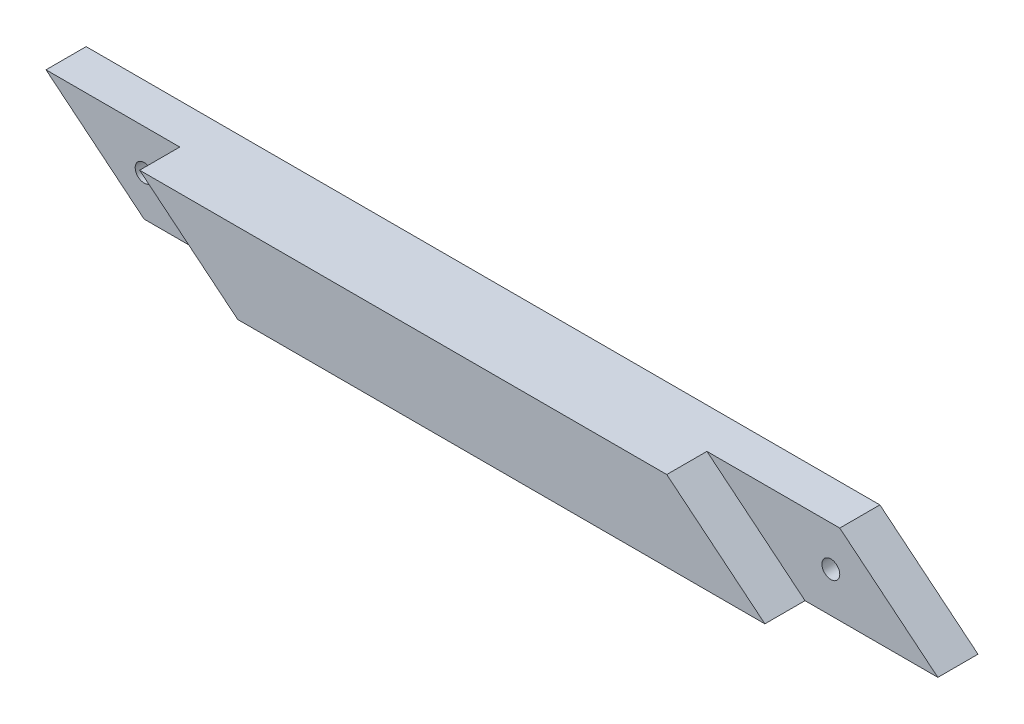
from build123d import *

# Parameters (mm, degrees)
ESQUISSE1_W             = 100
ESQUISSE1_H             = 9
EXTRUSION1_DEPTH        = 9
ENL_V_MAT_EXTRU_1_DEPTH = 9
ENL_V_MAT_EXTRU_2_DEPTH = 4.5
ESQUISSE4_R             = 1
ENL_V_MAT_EXTRU_3_DEPTH = 4.5
ENL_V_MAT_EXTRU_4_DEPTH = 9
ENL_V_MAT_EXTRU_5_DEPTH = 4.5
ESQUISSE7_R             = 1
ENL_V_MAT_EXTRU_6_DEPTH = 4.5


with BuildPart() as part:
    # Esquisse1 → Extrusion1 (new body)
    with BuildSketch(Plane.XY):
        with Locations((50, 4.5)):
            Rectangle(ESQUISSE1_W, ESQUISSE1_H)
    extrude(amount=EXTRUSION1_DEPTH)

    # Esquisse2 → Enl_v. mat.-Extru.1 (cut)
    with BuildSketch(Plane.XY.offset(9)):
        Polygon((0, 9), (11, 0), (0, 0), align=None)
    extrude(amount=-ENL_V_MAT_EXTRU_1_DEPTH, mode=Mode.SUBTRACT)

    # Esquisse3 → Enl_v. mat.-Extru.2 (cut)
    with BuildSketch(Plane.XY.offset(9)):
        Polygon((0, 9), (15, 9), (26, 0), (11, 0), align=None)
    extrude(amount=-ENL_V_MAT_EXTRU_2_DEPTH, mode=Mode.SUBTRACT)

    # Esquisse4 → Enl_v. mat.-Extru.3 (cut)
    with BuildSketch(Plane.XY.offset(4.5)):
        with Locations((11, 4.5)):
            Circle(ESQUISSE4_R)
    extrude(amount=-ENL_V_MAT_EXTRU_3_DEPTH, mode=Mode.SUBTRACT)

    # Esquisse5 → Enl_v. mat.-Extru.4 (cut)
    with BuildSketch(Plane.XY.offset(9)):
        Polygon((100, 0), (100, 9), (89, 9), align=None)
    extrude(amount=-ENL_V_MAT_EXTRU_4_DEPTH, mode=Mode.SUBTRACT)

    # Esquisse6 → Enl_v. mat.-Extru.5 (cut)
    with BuildSketch(Plane.XY.offset(9)):
        Polygon((89, 9), (74.104540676, 9), (85.104540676, 0), (100, 0), align=None)
    extrude(amount=-ENL_V_MAT_EXTRU_5_DEPTH, mode=Mode.SUBTRACT)

    # Esquisse7 → Enl_v. mat.-Extru.6 (cut)
    with BuildSketch(Plane.XY.offset(4.5)):
        with Locations((88, 4.5)):
            Circle(ESQUISSE7_R)
    extrude(amount=-ENL_V_MAT_EXTRU_6_DEPTH, mode=Mode.SUBTRACT)


solid = part.part
